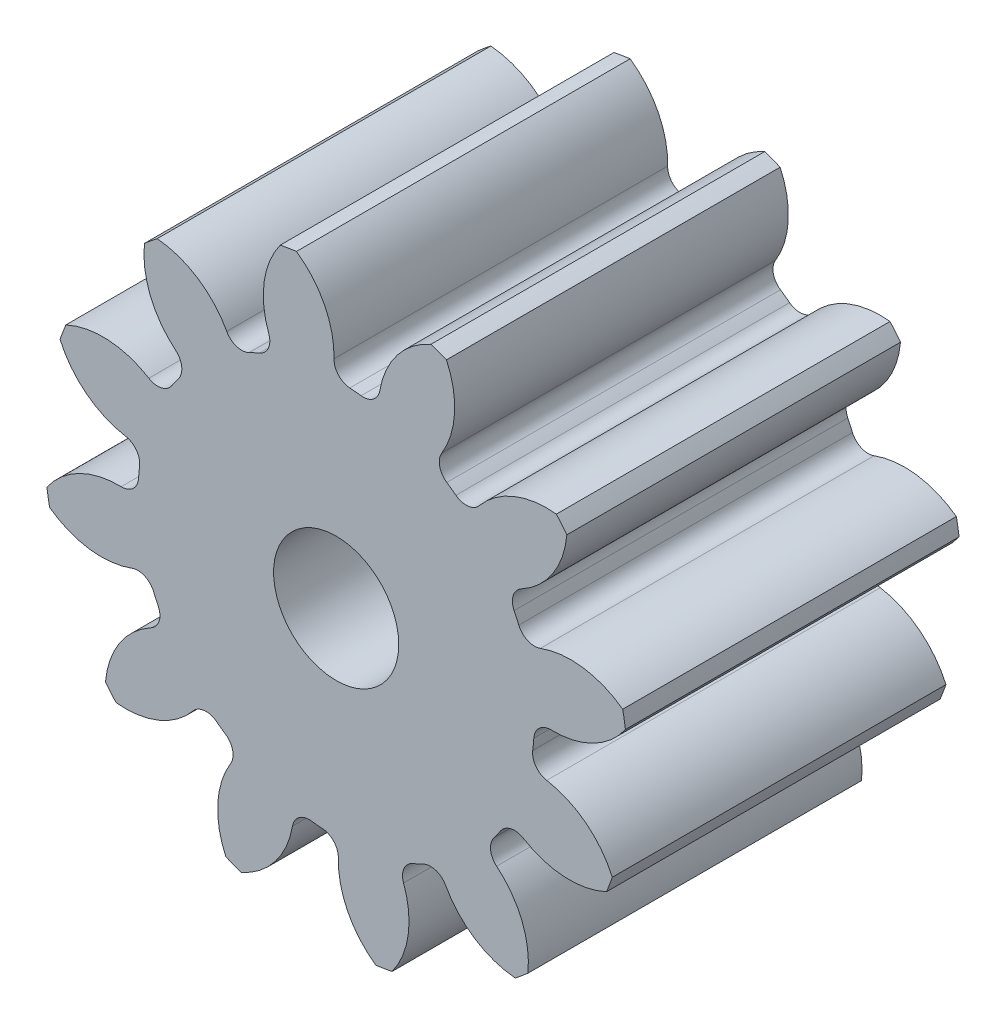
from build123d import *

# Parameters (mm, degrees)
SKETCH3_R         = 88.9
GEARBODY_DEPTH    = 101.6
TOOTHCUT_DEPTH    = 162.644610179
CIRPATTERN1_COUNT = 12
BOREDIA_R         = 19.05
BORE_DEPTH        = 12700


with BuildPart() as part:
    # Sketch3 → gearBody (new body)
    with BuildSketch(Plane.XY):
        Circle(SKETCH3_R)
    extrude(amount=GEARBODY_DEPTH)

    # Sketch2 → toothCut (cut, through all)
    with BuildSketch(Plane.XY):
        with BuildLine():
            ThreePointArc((59.848497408, -7.567230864), (60.039682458, -5.860218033), (60.18218968, -4.148453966))
            ThreePointArc((60.18218968, -4.148453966), (61.860344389, -0.680626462), (65.470868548, 0.663302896))
            ThreePointArc((65.470868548, 0.663302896), (78.874036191, 3.872770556), (88.9, 13.329283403))
            ThreePointArc((88.9, 13.329283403), (89.468545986, -8.73264423), (84.644631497, -30.268236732))
            ThreePointArc((84.644631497, -30.268236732), (76.636496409, -19.051492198), (64.106912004, -13.310838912))
            ThreePointArc((64.106912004, -13.310838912), (60.824407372, -11.294110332), (59.848497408, -7.567230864))
        make_face()
    toothcut = extrude(amount=TOOTHCUT_DEPTH, mode=Mode.SUBTRACT)

    # CirPattern1: toothCut ×12 about axis
    cirpattern1_axis = Axis((0, 0, 0), (0, 0, 1))
    for i in range(1, CIRPATTERN1_COUNT):
        add(toothcut.rotate(cirpattern1_axis, i * 360 / CIRPATTERN1_COUNT), mode=Mode.SUBTRACT)

    # boreDia → bore (cut, symmetric)
    with BuildSketch(Plane.XY):
        Circle(BOREDIA_R)
    extrude(amount=BORE_DEPTH, both=True, mode=Mode.SUBTRACT)


solid = part.part
